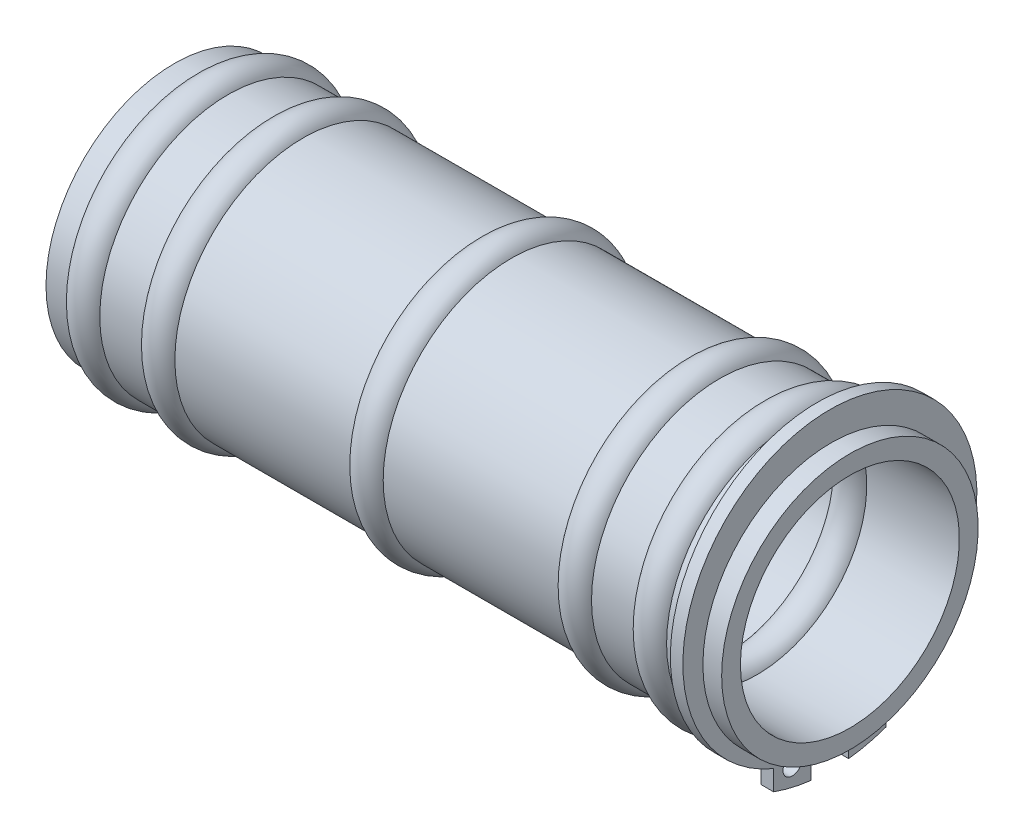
ISO-10303-21;
HEADER;
FILE_DESCRIPTION(('STEP AP214'),'2;1');
FILE_NAME('part.step','',(''),(''),'','','');
FILE_SCHEMA(('AUTOMOTIVE_DESIGN { 1 0 10303 214 1 1 1 1 }'));
ENDSEC;
DATA;
#1=APPLICATION_CONTEXT('core data for automotive mechanical design processes');
#2=APPLICATION_PROTOCOL_DEFINITION('international standard','automotive_design',2000,#1);
#3=PRODUCT_CONTEXT('',#1,'mechanical');
#4=PRODUCT('Part','Part','',(#3));
#5=PRODUCT_RELATED_PRODUCT_CATEGORY('part','',(#4));
#6=PRODUCT_DEFINITION_FORMATION('','',#4);
#7=PRODUCT_DEFINITION_CONTEXT('part definition',#1,'design');
#8=PRODUCT_DEFINITION('design','',#6,#7);
#9=PRODUCT_DEFINITION_SHAPE('','',#8);
#10=(LENGTH_UNIT() NAMED_UNIT(*) SI_UNIT(.MILLI.,.METRE.));
#11=(NAMED_UNIT(*) PLANE_ANGLE_UNIT() SI_UNIT($,.RADIAN.));
#12=(NAMED_UNIT(*) SI_UNIT($,.STERADIAN.) SOLID_ANGLE_UNIT());
#13=UNCERTAINTY_MEASURE_WITH_UNIT(LENGTH_MEASURE(1.E-05),#10,'distance_accuracy_value','');
#14=(GEOMETRIC_REPRESENTATION_CONTEXT(3) GLOBAL_UNCERTAINTY_ASSIGNED_CONTEXT((#13)) GLOBAL_UNIT_ASSIGNED_CONTEXT((#10,
#11,#12)) REPRESENTATION_CONTEXT('',''));
#15=CARTESIAN_POINT('',(0.,0.,0.));
#16=DIRECTION('',(0.,0.,1.));
#17=DIRECTION('',(1.,0.,0.));
#18=AXIS2_PLACEMENT_3D('',#15,#16,#17);
#19=CARTESIAN_POINT('',(54.,0.,0.));
#20=DIRECTION('',(-1.,0.,0.));
#21=DIRECTION('',(0.,0.,1.));
#22=AXIS2_PLACEMENT_3D('',#19,#20,#21);
#23=CYLINDRICAL_SURFACE('',#22,9.5);
#24=CARTESIAN_POINT('',(52.5,0.,0.));
#25=DIRECTION('',(-1.,0.,0.));
#26=DIRECTION('',(0.,0.,1.));
#27=AXIS2_PLACEMENT_3D('',#24,#25,#26);
#28=CIRCLE('',#27,9.5);
#29=CARTESIAN_POINT('',(52.5,0.,9.5));
#30=VERTEX_POINT('',#29);
#31=EDGE_CURVE('E203',#30,#30,#28,.T.);
#32=ORIENTED_EDGE('',*,*,#31,.T.);
#33=EDGE_LOOP('',(#32));
#34=FACE_BOUND('',#33,.T.);
#35=CARTESIAN_POINT('',(51.3,0.,0.));
#36=DIRECTION('',(-1.,0.,0.));
#37=DIRECTION('',(0.,0.,1.));
#38=AXIS2_PLACEMENT_3D('',#35,#36,#37);
#39=CIRCLE('',#38,9.5);
#40=CARTESIAN_POINT('',(51.3,0.,9.5));
#41=VERTEX_POINT('',#40);
#42=EDGE_CURVE('E200',#41,#41,#39,.T.);
#43=ORIENTED_EDGE('',*,*,#42,.F.);
#44=EDGE_LOOP('',(#43));
#45=FACE_BOUND('',#44,.T.);
#46=DIRECTION('',(-1.,0.,0.));
#47=VECTOR('',#46,1.);
#48=CARTESIAN_POINT('',(54.,-9.38083151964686,1.5));
#49=LINE('',#48,#47);
#50=CARTESIAN_POINT('',(51.4,-9.38083151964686,1.5));
#51=VERTEX_POINT('',#50);
#52=CARTESIAN_POINT('',(52.4,-9.38083151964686,1.5));
#53=VERTEX_POINT('',#52);
#54=EDGE_CURVE('E11',#51,#53,#49,.F.);
#55=ORIENTED_EDGE('',*,*,#54,.F.);
#56=CARTESIAN_POINT('',(51.4,0.,0.));
#57=DIRECTION('',(1.,0.,0.));
#58=DIRECTION('',(0.,0.,-1.));
#59=AXIS2_PLACEMENT_3D('',#56,#57,#58);
#60=CIRCLE('',#59,9.5);
#61=CARTESIAN_POINT('',(51.4,-9.38083151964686,-1.5));
#62=VERTEX_POINT('',#61);
#63=EDGE_CURVE('E237',#62,#51,#60,.T.);
#64=ORIENTED_EDGE('',*,*,#63,.F.);
#65=DIRECTION('',(-1.,0.,0.));
#66=VECTOR('',#65,1.);
#67=CARTESIAN_POINT('',(54.,-9.38083151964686,-1.5));
#68=LINE('',#67,#66);
#69=CARTESIAN_POINT('',(52.4,-9.38083151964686,-1.5));
#70=VERTEX_POINT('',#69);
#71=EDGE_CURVE('E170',#70,#62,#68,.T.);
#72=ORIENTED_EDGE('',*,*,#71,.F.);
#73=CARTESIAN_POINT('',(52.4,0.,0.));
#74=DIRECTION('',(1.,0.,0.));
#75=DIRECTION('',(0.,0.,-1.));
#76=AXIS2_PLACEMENT_3D('',#73,#74,#75);
#77=CIRCLE('',#76,9.5);
#78=EDGE_CURVE('E42',#70,#53,#77,.T.);
#79=ORIENTED_EDGE('',*,*,#78,.T.);
#80=EDGE_LOOP('',(#55,#64,#72,#79));
#81=FACE_BOUND('',#80,.T.);
#82=ADVANCED_FACE('F34',(#34,#45,#81),#23,.T.);
#83=CARTESIAN_POINT('',(54.,0.,0.));
#84=DIRECTION('',(-1.,0.,0.));
#85=DIRECTION('',(0.,0.,1.));
#86=AXIS2_PLACEMENT_3D('',#83,#84,#85);
#87=CYLINDRICAL_SURFACE('',#86,8.75);
#88=CARTESIAN_POINT('',(44.000961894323,0.,0.));
#89=DIRECTION('',(-1.,0.,0.));
#90=DIRECTION('',(0.,0.,1.));
#91=AXIS2_PLACEMENT_3D('',#88,#89,#90);
#92=CIRCLE('',#91,8.75);
#93=CARTESIAN_POINT('',(44.000961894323,0.,8.75));
#94=VERTEX_POINT('',#93);
#95=EDGE_CURVE('E218',#94,#94,#92,.T.);
#96=ORIENTED_EDGE('',*,*,#95,.F.);
#97=EDGE_LOOP('',(#96));
#98=FACE_BOUND('',#97,.T.);
#99=CARTESIAN_POINT('',(26.9490381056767,0.,0.));
#100=DIRECTION('',(-1.,0.,0.));
#101=DIRECTION('',(0.,0.,1.));
#102=AXIS2_PLACEMENT_3D('',#99,#100,#101);
#103=CIRCLE('',#102,8.75);
#104=CARTESIAN_POINT('',(26.9490381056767,0.,8.75));
#105=VERTEX_POINT('',#104);
#106=EDGE_CURVE('E163',#105,#105,#103,.F.);
#107=ORIENTED_EDGE('',*,*,#106,.F.);
#108=EDGE_LOOP('',(#107));
#109=FACE_BOUND('',#108,.T.);
#110=ADVANCED_FACE('F260',(#98,#109),#87,.F.);
#111=CARTESIAN_POINT('',(54.,0.,0.));
#112=DIRECTION('',(-1.,0.,0.));
#113=DIRECTION('',(0.,0.,1.));
#114=AXIS2_PLACEMENT_3D('',#111,#112,#113);
#115=CYLINDRICAL_SURFACE('',#114,10.25);
#116=CARTESIAN_POINT('',(41.000961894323,0.,0.));
#117=DIRECTION('',(-1.,0.,0.));
#118=DIRECTION('',(0.,0.,1.));
#119=AXIS2_PLACEMENT_3D('',#116,#117,#118);
#120=CIRCLE('',#119,10.25);
#121=CARTESIAN_POINT('',(41.000961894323,0.,10.25));
#122=VERTEX_POINT('',#121);
#123=EDGE_CURVE('E185',#122,#122,#120,.T.);
#124=ORIENTED_EDGE('',*,*,#123,.T.);
#125=EDGE_LOOP('',(#124));
#126=FACE_BOUND('',#125,.T.);
#127=CARTESIAN_POINT('',(26.9490381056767,0.,0.));
#128=DIRECTION('',(-1.,0.,0.));
#129=DIRECTION('',(0.,0.,1.));
#130=AXIS2_PLACEMENT_3D('',#127,#128,#129);
#131=CIRCLE('',#130,10.25);
#132=CARTESIAN_POINT('',(26.9490381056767,0.,10.25));
#133=VERTEX_POINT('',#132);
#134=EDGE_CURVE('E230',#133,#133,#131,.T.);
#135=ORIENTED_EDGE('',*,*,#134,.F.);
#136=EDGE_LOOP('',(#135));
#137=FACE_BOUND('',#136,.T.);
#138=ADVANCED_FACE('F266',(#126,#137),#115,.T.);
#139=CARTESIAN_POINT('',(45.3,0.,0.));
#140=DIRECTION('',(-1.,0.,0.));
#141=DIRECTION('',(0.,0.,1.));
#142=AXIS2_PLACEMENT_3D('',#139,#140,#141);
#143=TOROIDAL_SURFACE('',#142,9.50000000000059,1.50000000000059);
#144=CARTESIAN_POINT('',(46.599038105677,0.,0.));
#145=DIRECTION('',(-1.,0.,0.));
#146=DIRECTION('',(0.,0.,1.));
#147=AXIS2_PLACEMENT_3D('',#144,#145,#146);
#148=CIRCLE('',#147,8.75);
#149=CARTESIAN_POINT('',(46.599038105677,0.,8.75));
#150=VERTEX_POINT('',#149);
#151=EDGE_CURVE('E215',#150,#150,#148,.T.);
#152=ORIENTED_EDGE('',*,*,#151,.F.);
#153=EDGE_LOOP('',(#152));
#154=FACE_BOUND('',#153,.T.);
#155=ORIENTED_EDGE('',*,*,#95,.T.);
#156=EDGE_LOOP('',(#155));
#157=FACE_BOUND('',#156,.T.);
#158=ADVANCED_FACE('F290',(#154,#157),#143,.T.);
#159=CARTESIAN_POINT('',(54.,0.,0.));
#160=DIRECTION('',(-1.,0.,0.));
#161=DIRECTION('',(0.,0.,1.));
#162=AXIS2_PLACEMENT_3D('',#159,#160,#161);
#163=CYLINDRICAL_SURFACE('',#162,8.75);
#164=CARTESIAN_POINT('',(54.,0.,0.));
#165=DIRECTION('',(-1.,0.,0.));
#166=DIRECTION('',(0.,0.,1.));
#167=AXIS2_PLACEMENT_3D('',#164,#165,#166);
#168=CIRCLE('',#167,8.75);
#169=CARTESIAN_POINT('',(54.,0.,8.75));
#170=VERTEX_POINT('',#169);
#171=EDGE_CURVE('E212',#170,#170,#168,.T.);
#172=ORIENTED_EDGE('',*,*,#171,.F.);
#173=EDGE_LOOP('',(#172));
#174=FACE_BOUND('',#173,.T.);
#175=ORIENTED_EDGE('',*,*,#151,.T.);
#176=EDGE_LOOP('',(#175));
#177=FACE_BOUND('',#176,.T.);
#178=ADVANCED_FACE('F286',(#174,#177),#163,.F.);
#179=CARTESIAN_POINT('',(54.,8.75,0.));
#180=DIRECTION('',(-1.,0.,0.));
#181=DIRECTION('',(0.,0.,1.));
#182=AXIS2_PLACEMENT_3D('',#179,#180,#181);
#183=PLANE('',#182);
#184=CARTESIAN_POINT('',(54.,0.,0.));
#185=DIRECTION('',(-1.,0.,0.));
#186=DIRECTION('',(0.,0.,1.));
#187=AXIS2_PLACEMENT_3D('',#184,#185,#186);
#188=CIRCLE('',#187,10.25);
#189=CARTESIAN_POINT('',(54.,0.,10.25));
#190=VERTEX_POINT('',#189);
#191=EDGE_CURVE('E209',#190,#190,#188,.T.);
#192=ORIENTED_EDGE('',*,*,#191,.F.);
#193=EDGE_LOOP('',(#192));
#194=FACE_BOUND('',#193,.T.);
#195=ORIENTED_EDGE('',*,*,#171,.T.);
#196=EDGE_LOOP('',(#195));
#197=FACE_BOUND('',#196,.T.);
#198=ADVANCED_FACE('F282',(#194,#197),#183,.F.);
#199=CARTESIAN_POINT('',(54.,0.,0.));
#200=DIRECTION('',(-1.,0.,0.));
#201=DIRECTION('',(0.,0.,1.));
#202=AXIS2_PLACEMENT_3D('',#199,#200,#201);
#203=CYLINDRICAL_SURFACE('',#202,10.25);
#204=CARTESIAN_POINT('',(52.5,0.,0.));
#205=DIRECTION('',(-1.,0.,0.));
#206=DIRECTION('',(0.,0.,1.));
#207=AXIS2_PLACEMENT_3D('',#204,#205,#206);
#208=CIRCLE('',#207,10.25);
#209=CARTESIAN_POINT('',(52.5,0.,10.25));
#210=VERTEX_POINT('',#209);
#211=EDGE_CURVE('E206',#210,#210,#208,.T.);
#212=ORIENTED_EDGE('',*,*,#211,.F.);
#213=EDGE_LOOP('',(#212));
#214=FACE_BOUND('',#213,.T.);
#215=ORIENTED_EDGE('',*,*,#191,.T.);
#216=EDGE_LOOP('',(#215));
#217=FACE_BOUND('',#216,.T.);
#218=ADVANCED_FACE('F278',(#214,#217),#203,.T.);
#219=CARTESIAN_POINT('',(52.5,10.25,0.));
#220=DIRECTION('',(1.,0.,0.));
#221=DIRECTION('',(0.,0.,-1.));
#222=AXIS2_PLACEMENT_3D('',#219,#220,#221);
#223=PLANE('',#222);
#224=ORIENTED_EDGE('',*,*,#31,.F.);
#225=EDGE_LOOP('',(#224));
#226=FACE_BOUND('',#225,.T.);
#227=ORIENTED_EDGE('',*,*,#211,.T.);
#228=EDGE_LOOP('',(#227));
#229=FACE_BOUND('',#228,.T.);
#230=ADVANCED_FACE('F275',(#226,#229),#223,.F.);
#231=CARTESIAN_POINT('',(51.3,9.5,0.));
#232=DIRECTION('',(-1.,0.,0.));
#233=DIRECTION('',(0.,0.,1.));
#234=AXIS2_PLACEMENT_3D('',#231,#232,#233);
#235=PLANE('',#234);
#236=CARTESIAN_POINT('',(51.3,0.,0.));
#237=DIRECTION('',(-1.,0.,0.));
#238=DIRECTION('',(0.,0.,1.));
#239=AXIS2_PLACEMENT_3D('',#236,#237,#238);
#240=CIRCLE('',#239,10.25);
#241=CARTESIAN_POINT('',(51.3,0.,10.25));
#242=VERTEX_POINT('',#241);
#243=EDGE_CURVE('E197',#242,#242,#240,.T.);
#244=ORIENTED_EDGE('',*,*,#243,.F.);
#245=EDGE_LOOP('',(#244));
#246=FACE_BOUND('',#245,.T.);
#247=ORIENTED_EDGE('',*,*,#42,.T.);
#248=EDGE_LOOP('',(#247));
#249=FACE_BOUND('',#248,.T.);
#250=ADVANCED_FACE('F273',(#246,#249),#235,.F.);
#251=CARTESIAN_POINT('',(54.,0.,0.));
#252=DIRECTION('',(-1.,0.,0.));
#253=DIRECTION('',(0.,0.,1.));
#254=AXIS2_PLACEMENT_3D('',#251,#252,#253);
#255=CYLINDRICAL_SURFACE('',#254,10.25);
#256=CARTESIAN_POINT('',(49.599038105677,0.,0.));
#257=DIRECTION('',(-1.,0.,0.));
#258=DIRECTION('',(0.,0.,1.));
#259=AXIS2_PLACEMENT_3D('',#256,#257,#258);
#260=CIRCLE('',#259,10.25);
#261=CARTESIAN_POINT('',(49.599038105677,0.,10.25));
#262=VERTEX_POINT('',#261);
#263=EDGE_CURVE('E194',#262,#262,#260,.T.);
#264=ORIENTED_EDGE('',*,*,#263,.F.);
#265=EDGE_LOOP('',(#264));
#266=FACE_BOUND('',#265,.T.);
#267=ORIENTED_EDGE('',*,*,#243,.T.);
#268=EDGE_LOOP('',(#267));
#269=FACE_BOUND('',#268,.T.);
#270=ADVANCED_FACE('F492',(#266,#269),#255,.T.);
#271=CARTESIAN_POINT('',(48.3,0.,0.));
#272=DIRECTION('',(-1.,0.,0.));
#273=DIRECTION('',(0.,0.,1.));
#274=AXIS2_PLACEMENT_3D('',#271,#272,#273);
#275=TOROIDAL_SURFACE('',#274,9.4999999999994,1.5000000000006);
#276=CARTESIAN_POINT('',(47.000961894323,0.,0.));
#277=DIRECTION('',(-1.,0.,0.));
#278=DIRECTION('',(0.,0.,1.));
#279=AXIS2_PLACEMENT_3D('',#276,#277,#278);
#280=CIRCLE('',#279,10.25);
#281=CARTESIAN_POINT('',(47.000961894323,0.,10.25));
#282=VERTEX_POINT('',#281);
#283=EDGE_CURVE('E191',#282,#282,#280,.T.);
#284=ORIENTED_EDGE('',*,*,#283,.F.);
#285=EDGE_LOOP('',(#284));
#286=FACE_BOUND('',#285,.T.);
#287=ORIENTED_EDGE('',*,*,#263,.T.);
#288=EDGE_LOOP('',(#287));
#289=FACE_BOUND('',#288,.T.);
#290=ADVANCED_FACE('F501',(#286,#289),#275,.T.);
#291=CARTESIAN_POINT('',(54.,0.,0.));
#292=DIRECTION('',(-1.,0.,0.));
#293=DIRECTION('',(0.,0.,1.));
#294=AXIS2_PLACEMENT_3D('',#291,#292,#293);
#295=CYLINDRICAL_SURFACE('',#294,10.25);
#296=CARTESIAN_POINT('',(43.599038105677,0.,0.));
#297=DIRECTION('',(-1.,0.,0.));
#298=DIRECTION('',(0.,0.,1.));
#299=AXIS2_PLACEMENT_3D('',#296,#297,#298);
#300=CIRCLE('',#299,10.25);
#301=CARTESIAN_POINT('',(43.599038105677,0.,10.25));
#302=VERTEX_POINT('',#301);
#303=EDGE_CURVE('E188',#302,#302,#300,.T.);
#304=ORIENTED_EDGE('',*,*,#303,.F.);
#305=EDGE_LOOP('',(#304));
#306=FACE_BOUND('',#305,.T.);
#307=ORIENTED_EDGE('',*,*,#283,.T.);
#308=EDGE_LOOP('',(#307));
#309=FACE_BOUND('',#308,.T.);
#310=ADVANCED_FACE('F352',(#306,#309),#295,.T.);
#311=CARTESIAN_POINT('',(42.3,0.,0.));
#312=DIRECTION('',(-1.,0.,0.));
#313=DIRECTION('',(0.,0.,1.));
#314=AXIS2_PLACEMENT_3D('',#311,#312,#313);
#315=TOROIDAL_SURFACE('',#314,9.4999999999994,1.5000000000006);
#316=ORIENTED_EDGE('',*,*,#123,.F.);
#317=EDGE_LOOP('',(#316));
#318=FACE_BOUND('',#317,.T.);
#319=ORIENTED_EDGE('',*,*,#303,.T.);
#320=EDGE_LOOP('',(#319));
#321=FACE_BOUND('',#320,.T.);
#322=ADVANCED_FACE('F346',(#318,#321),#315,.T.);
#323=CARTESIAN_POINT('',(25.65,0.,0.));
#324=DIRECTION('',(-1.,0.,0.));
#325=DIRECTION('',(0.,0.,1.));
#326=AXIS2_PLACEMENT_3D('',#323,#324,#325);
#327=TOROIDAL_SURFACE('',#326,9.5,1.5);
#328=ORIENTED_EDGE('',*,*,#134,.T.);
#329=EDGE_LOOP('',(#328));
#330=FACE_BOUND('',#329,.T.);
#331=CARTESIAN_POINT('',(24.3509618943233,0.,0.));
#332=DIRECTION('',(1.,0.,0.));
#333=DIRECTION('',(0.,0.,-1.));
#334=AXIS2_PLACEMENT_3D('',#331,#332,#333);
#335=CIRCLE('',#334,10.25);
#336=CARTESIAN_POINT('',(24.3509618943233,0.,-10.25));
#337=VERTEX_POINT('',#336);
#338=EDGE_CURVE('E167',#337,#337,#335,.T.);
#339=ORIENTED_EDGE('',*,*,#338,.T.);
#340=EDGE_LOOP('',(#339));
#341=FACE_BOUND('',#340,.T.);
#342=ADVANCED_FACE('F307',(#330,#341),#327,.T.);
#343=CARTESIAN_POINT('',(0.,10.25,0.));
#344=DIRECTION('',(1.,0.,0.));
#345=DIRECTION('',(0.,0.,-1.));
#346=AXIS2_PLACEMENT_3D('',#343,#344,#345);
#347=PLANE('',#346);
#348=CARTESIAN_POINT('',(0.,0.,0.));
#349=DIRECTION('',(-1.,0.,0.));
#350=DIRECTION('',(0.,0.,1.));
#351=AXIS2_PLACEMENT_3D('',#348,#349,#350);
#352=CIRCLE('',#351,8.75);
#353=CARTESIAN_POINT('',(0.,0.,8.75));
#354=VERTEX_POINT('',#353);
#355=EDGE_CURVE('E227',#354,#354,#352,.T.);
#356=ORIENTED_EDGE('',*,*,#355,.F.);
#357=EDGE_LOOP('',(#356));
#358=FACE_BOUND('',#357,.T.);
#359=CARTESIAN_POINT('',(0.,0.,0.));
#360=DIRECTION('',(-1.,0.,0.));
#361=DIRECTION('',(0.,0.,1.));
#362=AXIS2_PLACEMENT_3D('',#359,#360,#361);
#363=CIRCLE('',#362,10.25);
#364=CARTESIAN_POINT('',(0.,0.,10.25));
#365=VERTEX_POINT('',#364);
#366=EDGE_CURVE('E114',#365,#365,#363,.T.);
#367=ORIENTED_EDGE('',*,*,#366,.T.);
#368=EDGE_LOOP('',(#367));
#369=FACE_BOUND('',#368,.T.);
#370=ADVANCED_FACE('F36',(#358,#369),#347,.F.);
#371=CARTESIAN_POINT('',(54.,0.,0.));
#372=DIRECTION('',(-1.,0.,0.));
#373=DIRECTION('',(0.,0.,1.));
#374=AXIS2_PLACEMENT_3D('',#371,#372,#373);
#375=CYLINDRICAL_SURFACE('',#374,8.75);
#376=CARTESIAN_POINT('',(4.7009618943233,0.,0.));
#377=DIRECTION('',(-1.,0.,0.));
#378=DIRECTION('',(0.,0.,1.));
#379=AXIS2_PLACEMENT_3D('',#376,#377,#378);
#380=CIRCLE('',#379,8.75);
#381=CARTESIAN_POINT('',(4.7009618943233,0.,8.75));
#382=VERTEX_POINT('',#381);
#383=EDGE_CURVE('E224',#382,#382,#380,.T.);
#384=ORIENTED_EDGE('',*,*,#383,.F.);
#385=EDGE_LOOP('',(#384));
#386=FACE_BOUND('',#385,.T.);
#387=ORIENTED_EDGE('',*,*,#355,.T.);
#388=EDGE_LOOP('',(#387));
#389=FACE_BOUND('',#388,.T.);
#390=ADVANCED_FACE('F300',(#386,#389),#375,.F.);
#391=CARTESIAN_POINT('',(6.,0.,0.));
#392=DIRECTION('',(-1.,0.,0.));
#393=DIRECTION('',(0.,0.,1.));
#394=AXIS2_PLACEMENT_3D('',#391,#392,#393);
#395=TOROIDAL_SURFACE('',#394,9.50000000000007,1.50000000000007);
#396=CARTESIAN_POINT('',(7.2990381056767,0.,0.));
#397=DIRECTION('',(-1.,0.,0.));
#398=DIRECTION('',(0.,0.,1.));
#399=AXIS2_PLACEMENT_3D('',#396,#397,#398);
#400=CIRCLE('',#399,8.75);
#401=CARTESIAN_POINT('',(7.2990381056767,0.,8.75));
#402=VERTEX_POINT('',#401);
#403=EDGE_CURVE('E221',#402,#402,#400,.T.);
#404=ORIENTED_EDGE('',*,*,#403,.F.);
#405=EDGE_LOOP('',(#404));
#406=FACE_BOUND('',#405,.T.);
#407=ORIENTED_EDGE('',*,*,#383,.T.);
#408=EDGE_LOOP('',(#407));
#409=FACE_BOUND('',#408,.T.);
#410=ADVANCED_FACE('F297',(#406,#409),#395,.T.);
#411=ORIENTED_EDGE('',*,*,#403,.T.);
#412=EDGE_LOOP('',(#411));
#413=FACE_BOUND('',#412,.T.);
#414=CARTESIAN_POINT('',(24.3509618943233,0.,0.));
#415=DIRECTION('',(1.,0.,0.));
#416=DIRECTION('',(0.,0.,-1.));
#417=AXIS2_PLACEMENT_3D('',#414,#415,#416);
#418=CIRCLE('',#417,8.75);
#419=CARTESIAN_POINT('',(24.3509618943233,0.,-8.75));
#420=VERTEX_POINT('',#419);
#421=EDGE_CURVE('E166',#420,#420,#418,.F.);
#422=ORIENTED_EDGE('',*,*,#421,.F.);
#423=EDGE_LOOP('',(#422));
#424=FACE_BOUND('',#423,.T.);
#425=ADVANCED_FACE('F269',(#413,#424),#87,.F.);
#426=CARTESIAN_POINT('',(54.,0.,0.));
#427=DIRECTION('',(-1.,0.,0.));
#428=DIRECTION('',(0.,0.,1.));
#429=AXIS2_PLACEMENT_3D('',#426,#427,#428);
#430=CYLINDRICAL_SURFACE('',#429,10.25);
#431=ORIENTED_EDGE('',*,*,#366,.F.);
#432=EDGE_LOOP('',(#431));
#433=FACE_BOUND('',#432,.T.);
#434=CARTESIAN_POINT('',(1.7009618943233,0.,0.));
#435=DIRECTION('',(-1.,0.,0.));
#436=DIRECTION('',(0.,0.,1.));
#437=AXIS2_PLACEMENT_3D('',#434,#435,#436);
#438=CIRCLE('',#437,10.25);
#439=CARTESIAN_POINT('',(1.7009618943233,0.,10.25));
#440=VERTEX_POINT('',#439);
#441=EDGE_CURVE('E173',#440,#440,#438,.T.);
#442=ORIENTED_EDGE('',*,*,#441,.T.);
#443=EDGE_LOOP('',(#442));
#444=FACE_BOUND('',#443,.T.);
#445=ADVANCED_FACE('F296',(#433,#444),#430,.T.);
#446=CARTESIAN_POINT('',(3.,0.,0.));
#447=DIRECTION('',(-1.,0.,0.));
#448=DIRECTION('',(0.,0.,1.));
#449=AXIS2_PLACEMENT_3D('',#446,#447,#448);
#450=TOROIDAL_SURFACE('',#449,9.49999999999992,1.50000000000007);
#451=ORIENTED_EDGE('',*,*,#441,.F.);
#452=EDGE_LOOP('',(#451));
#453=FACE_BOUND('',#452,.T.);
#454=CARTESIAN_POINT('',(4.2990381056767,0.,0.));
#455=DIRECTION('',(-1.,0.,0.));
#456=DIRECTION('',(0.,0.,1.));
#457=AXIS2_PLACEMENT_3D('',#454,#455,#456);
#458=CIRCLE('',#457,10.25);
#459=CARTESIAN_POINT('',(4.2990381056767,0.,10.25));
#460=VERTEX_POINT('',#459);
#461=EDGE_CURVE('E176',#460,#460,#458,.T.);
#462=ORIENTED_EDGE('',*,*,#461,.T.);
#463=EDGE_LOOP('',(#462));
#464=FACE_BOUND('',#463,.T.);
#465=ADVANCED_FACE('F317',(#453,#464),#450,.T.);
#466=CARTESIAN_POINT('',(54.,0.,0.));
#467=DIRECTION('',(-1.,0.,0.));
#468=DIRECTION('',(0.,0.,1.));
#469=AXIS2_PLACEMENT_3D('',#466,#467,#468);
#470=CYLINDRICAL_SURFACE('',#469,10.25);
#471=ORIENTED_EDGE('',*,*,#461,.F.);
#472=EDGE_LOOP('',(#471));
#473=FACE_BOUND('',#472,.T.);
#474=CARTESIAN_POINT('',(7.7009618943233,0.,0.));
#475=DIRECTION('',(-1.,0.,0.));
#476=DIRECTION('',(0.,0.,1.));
#477=AXIS2_PLACEMENT_3D('',#474,#475,#476);
#478=CIRCLE('',#477,10.25);
#479=CARTESIAN_POINT('',(7.7009618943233,0.,10.25));
#480=VERTEX_POINT('',#479);
#481=EDGE_CURVE('E179',#480,#480,#478,.T.);
#482=ORIENTED_EDGE('',*,*,#481,.T.);
#483=EDGE_LOOP('',(#482));
#484=FACE_BOUND('',#483,.T.);
#485=ADVANCED_FACE('F323',(#473,#484),#470,.T.);
#486=CARTESIAN_POINT('',(9.00000000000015,0.,0.));
#487=DIRECTION('',(-1.,0.,0.));
#488=DIRECTION('',(0.,0.,1.));
#489=AXIS2_PLACEMENT_3D('',#486,#487,#488);
#490=TOROIDAL_SURFACE('',#489,9.49999999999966,1.50000000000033);
#491=ORIENTED_EDGE('',*,*,#481,.F.);
#492=EDGE_LOOP('',(#491));
#493=FACE_BOUND('',#492,.T.);
#494=CARTESIAN_POINT('',(10.299038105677,0.,0.));
#495=DIRECTION('',(-1.,0.,0.));
#496=DIRECTION('',(0.,0.,1.));
#497=AXIS2_PLACEMENT_3D('',#494,#495,#496);
#498=CIRCLE('',#497,10.25);
#499=CARTESIAN_POINT('',(10.299038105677,0.,10.25));
#500=VERTEX_POINT('',#499);
#501=EDGE_CURVE('E182',#500,#500,#498,.T.);
#502=ORIENTED_EDGE('',*,*,#501,.T.);
#503=EDGE_LOOP('',(#502));
#504=FACE_BOUND('',#503,.T.);
#505=ADVANCED_FACE('F329',(#493,#504),#490,.T.);
#506=ORIENTED_EDGE('',*,*,#501,.F.);
#507=EDGE_LOOP('',(#506));
#508=FACE_BOUND('',#507,.T.);
#509=ORIENTED_EDGE('',*,*,#338,.F.);
#510=EDGE_LOOP('',(#509));
#511=FACE_BOUND('',#510,.T.);
#512=ADVANCED_FACE('F335',(#508,#511),#115,.T.);
#513=ORIENTED_EDGE('',*,*,#106,.T.);
#514=EDGE_LOOP('',(#513));
#515=FACE_BOUND('',#514,.T.);
#516=ORIENTED_EDGE('',*,*,#421,.T.);
#517=EDGE_LOOP('',(#516));
#518=FACE_BOUND('',#517,.T.);
#519=ADVANCED_FACE('F341',(#515,#518),#327,.T.);
#520=CARTESIAN_POINT('',(52.4,0.750000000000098,0.));
#521=DIRECTION('',(1.,0.,0.));
#522=DIRECTION('',(0.,0.,-1.));
#523=AXIS2_PLACEMENT_3D('',#520,#521,#522);
#524=PLANE('',#523);
#525=CARTESIAN_POINT('',(52.4,-10.610567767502,3.));
#526=DIRECTION('',(1.,0.,0.));
#527=DIRECTION('',(0.,0.,-1.));
#528=AXIS2_PLACEMENT_3D('',#525,#526,#527);
#529=CIRCLE('',#528,0.75);
#530=CARTESIAN_POINT('',(52.4,-10.610567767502,2.25));
#531=VERTEX_POINT('',#530);
#532=EDGE_CURVE('E695',#531,#531,#529,.T.);
#533=ORIENTED_EDGE('',*,*,#532,.F.);
#534=EDGE_LOOP('',(#533));
#535=FACE_BOUND('',#534,.T.);
#536=CARTESIAN_POINT('',(52.4,-10.610567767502,-3.));
#537=DIRECTION('',(1.,0.,0.));
#538=DIRECTION('',(0.,0.,-1.));
#539=AXIS2_PLACEMENT_3D('',#536,#537,#538);
#540=CIRCLE('',#539,0.75);
#541=CARTESIAN_POINT('',(52.4,-10.610567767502,-3.75));
#542=VERTEX_POINT('',#541);
#543=EDGE_CURVE('E121',#542,#542,#540,.T.);
#544=ORIENTED_EDGE('',*,*,#543,.F.);
#545=EDGE_LOOP('',(#544));
#546=FACE_BOUND('',#545,.T.);
#547=ORIENTED_EDGE('',*,*,#78,.F.);
#548=DIRECTION('',(0.,-1.,0.));
#549=VECTOR('',#548,1.);
#550=CARTESIAN_POINT('',(52.4,-9.178235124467,-1.5));
#551=LINE('',#550,#549);
#552=CARTESIAN_POINT('',(52.4,-12.414820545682,-1.49999999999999));
#553=VERTEX_POINT('',#552);
#554=EDGE_CURVE('E146',#70,#553,#551,.T.);
#555=ORIENTED_EDGE('',*,*,#554,.T.);
#556=CARTESIAN_POINT('',(52.4,0.750000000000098,0.));
#557=DIRECTION('',(1.,0.,0.));
#558=DIRECTION('',(0.,0.,-1.));
#559=AXIS2_PLACEMENT_3D('',#556,#557,#558);
#560=CIRCLE('',#559,13.2500000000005);
#561=CARTESIAN_POINT('',(52.4,-11.712443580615,-4.5));
#562=VERTEX_POINT('',#561);
#563=EDGE_CURVE('E148',#553,#562,#560,.T.);
#564=ORIENTED_EDGE('',*,*,#563,.T.);
#565=DIRECTION('',(0.,1.,0.));
#566=VECTOR('',#565,1.);
#567=CARTESIAN_POINT('',(52.4,-11.712443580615,-4.5));
#568=LINE('',#567,#566);
#569=CARTESIAN_POINT('',(52.4,-10.104146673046,-4.5));
#570=VERTEX_POINT('',#569);
#571=EDGE_CURVE('E150',#562,#570,#568,.T.);
#572=ORIENTED_EDGE('',*,*,#571,.T.);
#573=CARTESIAN_POINT('',(52.4,0.750000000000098,0.));
#574=DIRECTION('',(1.,0.,0.));
#575=DIRECTION('',(0.,0.,-1.));
#576=AXIS2_PLACEMENT_3D('',#573,#574,#575);
#577=CIRCLE('',#576,11.7499999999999);
#578=CARTESIAN_POINT('',(52.4,-10.104146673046,4.5));
#579=VERTEX_POINT('',#578);
#580=EDGE_CURVE('E138',#570,#579,#577,.T.);
#581=ORIENTED_EDGE('',*,*,#580,.T.);
#582=DIRECTION('',(0.,-1.,0.));
#583=VECTOR('',#582,1.);
#584=CARTESIAN_POINT('',(52.4,-10.104146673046,4.5));
#585=LINE('',#584,#583);
#586=CARTESIAN_POINT('',(52.4,-11.712443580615,4.5));
#587=VERTEX_POINT('',#586);
#588=EDGE_CURVE('E110',#579,#587,#585,.T.);
#589=ORIENTED_EDGE('',*,*,#588,.T.);
#590=CARTESIAN_POINT('',(52.4,0.750000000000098,0.));
#591=DIRECTION('',(1.,0.,0.));
#592=DIRECTION('',(0.,0.,-1.));
#593=AXIS2_PLACEMENT_3D('',#590,#591,#592);
#594=CIRCLE('',#593,13.2500000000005);
#595=CARTESIAN_POINT('',(52.4,-12.414820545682,1.5));
#596=VERTEX_POINT('',#595);
#597=EDGE_CURVE('E141',#587,#596,#594,.T.);
#598=ORIENTED_EDGE('',*,*,#597,.T.);
#599=DIRECTION('',(0.,1.,0.));
#600=VECTOR('',#599,1.);
#601=CARTESIAN_POINT('',(52.4,-12.414820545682,1.5));
#602=LINE('',#601,#600);
#603=EDGE_CURVE('E143',#596,#53,#602,.T.);
#604=ORIENTED_EDGE('',*,*,#603,.T.);
#605=EDGE_LOOP('',(#547,#555,#564,#572,#581,#589,#598,#604));
#606=FACE_BOUND('',#605,.T.);
#607=ADVANCED_FACE('F247',(#535,#546,#606),#524,.T.);
#608=CARTESIAN_POINT('',(51.4,0.750000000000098,0.));
#609=DIRECTION('',(1.,0.,0.));
#610=DIRECTION('',(0.,0.,-1.));
#611=AXIS2_PLACEMENT_3D('',#608,#609,#610);
#612=PLANE('',#611);
#613=CARTESIAN_POINT('',(51.4,-10.610567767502,3.));
#614=DIRECTION('',(1.,0.,0.));
#615=DIRECTION('',(0.,0.,-1.));
#616=AXIS2_PLACEMENT_3D('',#613,#614,#615);
#617=CIRCLE('',#616,0.75);
#618=CARTESIAN_POINT('',(51.4,-10.610567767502,2.25));
#619=VERTEX_POINT('',#618);
#620=EDGE_CURVE('E698',#619,#619,#617,.T.);
#621=ORIENTED_EDGE('',*,*,#620,.T.);
#622=EDGE_LOOP('',(#621));
#623=FACE_BOUND('',#622,.T.);
#624=CARTESIAN_POINT('',(51.4,-10.610567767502,-3.));
#625=DIRECTION('',(1.,0.,0.));
#626=DIRECTION('',(0.,0.,-1.));
#627=AXIS2_PLACEMENT_3D('',#624,#625,#626);
#628=CIRCLE('',#627,0.75);
#629=CARTESIAN_POINT('',(51.4,-10.610567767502,-3.75));
#630=VERTEX_POINT('',#629);
#631=EDGE_CURVE('E124',#630,#630,#628,.T.);
#632=ORIENTED_EDGE('',*,*,#631,.T.);
#633=EDGE_LOOP('',(#632));
#634=FACE_BOUND('',#633,.T.);
#635=DIRECTION('',(0.,-1.,0.));
#636=VECTOR('',#635,1.);
#637=CARTESIAN_POINT('',(51.4,-9.178235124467,-1.5));
#638=LINE('',#637,#636);
#639=CARTESIAN_POINT('',(51.4,-12.414820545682,-1.49999999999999));
#640=VERTEX_POINT('',#639);
#641=EDGE_CURVE('E132',#62,#640,#638,.T.);
#642=ORIENTED_EDGE('',*,*,#641,.F.);
#643=ORIENTED_EDGE('',*,*,#63,.T.);
#644=DIRECTION('',(0.,1.,0.));
#645=VECTOR('',#644,1.);
#646=CARTESIAN_POINT('',(51.4,-12.414820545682,1.5));
#647=LINE('',#646,#645);
#648=CARTESIAN_POINT('',(51.4,-12.414820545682,1.5));
#649=VERTEX_POINT('',#648);
#650=EDGE_CURVE('E129',#649,#51,#647,.T.);
#651=ORIENTED_EDGE('',*,*,#650,.F.);
#652=CARTESIAN_POINT('',(51.4,0.750000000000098,0.));
#653=DIRECTION('',(1.,0.,0.));
#654=DIRECTION('',(0.,0.,-1.));
#655=AXIS2_PLACEMENT_3D('',#652,#653,#654);
#656=CIRCLE('',#655,13.2500000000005);
#657=CARTESIAN_POINT('',(51.4,-11.712443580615,4.5));
#658=VERTEX_POINT('',#657);
#659=EDGE_CURVE('E102',#658,#649,#656,.T.);
#660=ORIENTED_EDGE('',*,*,#659,.F.);
#661=DIRECTION('',(0.,-1.,0.));
#662=VECTOR('',#661,1.);
#663=CARTESIAN_POINT('',(51.4,-10.104146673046,4.5));
#664=LINE('',#663,#662);
#665=CARTESIAN_POINT('',(51.4,-10.104146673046,4.5));
#666=VERTEX_POINT('',#665);
#667=EDGE_CURVE('E94',#666,#658,#664,.T.);
#668=ORIENTED_EDGE('',*,*,#667,.F.);
#669=CARTESIAN_POINT('',(51.4,0.750000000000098,0.));
#670=DIRECTION('',(1.,0.,0.));
#671=DIRECTION('',(0.,0.,-1.));
#672=AXIS2_PLACEMENT_3D('',#669,#670,#671);
#673=CIRCLE('',#672,11.7499999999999);
#674=CARTESIAN_POINT('',(51.4,-10.104146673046,-4.5));
#675=VERTEX_POINT('',#674);
#676=EDGE_CURVE('E100',#675,#666,#673,.T.);
#677=ORIENTED_EDGE('',*,*,#676,.F.);
#678=DIRECTION('',(0.,1.,0.));
#679=VECTOR('',#678,1.);
#680=CARTESIAN_POINT('',(51.4,-11.712443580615,-4.5));
#681=LINE('',#680,#679);
#682=CARTESIAN_POINT('',(51.4,-11.712443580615,-4.5));
#683=VERTEX_POINT('',#682);
#684=EDGE_CURVE('E136',#683,#675,#681,.T.);
#685=ORIENTED_EDGE('',*,*,#684,.F.);
#686=CARTESIAN_POINT('',(51.4,0.750000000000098,0.));
#687=DIRECTION('',(1.,0.,0.));
#688=DIRECTION('',(0.,0.,-1.));
#689=AXIS2_PLACEMENT_3D('',#686,#687,#688);
#690=CIRCLE('',#689,13.2500000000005);
#691=EDGE_CURVE('E134',#640,#683,#690,.T.);
#692=ORIENTED_EDGE('',*,*,#691,.F.);
#693=EDGE_LOOP('',(#642,#643,#651,#660,#668,#677,#685,#692));
#694=FACE_BOUND('',#693,.T.);
#695=ADVANCED_FACE('F97',(#623,#634,#694),#612,.F.);
#696=CARTESIAN_POINT('',(52.4,-12.414820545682,1.5));
#697=DIRECTION('',(0.,0.,1.));
#698=DIRECTION('',(1.,0.,0.));
#699=AXIS2_PLACEMENT_3D('',#696,#697,#698);
#700=PLANE('',#699);
#701=ORIENTED_EDGE('',*,*,#650,.T.);
#702=ORIENTED_EDGE('',*,*,#54,.T.);
#703=ORIENTED_EDGE('',*,*,#603,.F.);
#704=DIRECTION('',(-1.,0.,0.));
#705=VECTOR('',#704,1.);
#706=CARTESIAN_POINT('',(52.4,-12.414820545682,1.5));
#707=LINE('',#706,#705);
#708=EDGE_CURVE('E159',#596,#649,#707,.T.);
#709=ORIENTED_EDGE('',*,*,#708,.T.);
#710=EDGE_LOOP('',(#701,#702,#703,#709));
#711=FACE_BOUND('',#710,.T.);
#712=ADVANCED_FACE('F240',(#711),#700,.F.);
#713=CARTESIAN_POINT('',(52.4,-9.178235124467,-1.5));
#714=DIRECTION('',(0.,0.,-1.));
#715=DIRECTION('',(-1.,0.,0.));
#716=AXIS2_PLACEMENT_3D('',#713,#714,#715);
#717=PLANE('',#716);
#718=ORIENTED_EDGE('',*,*,#554,.F.);
#719=ORIENTED_EDGE('',*,*,#71,.T.);
#720=ORIENTED_EDGE('',*,*,#641,.T.);
#721=DIRECTION('',(-1.,0.,0.));
#722=VECTOR('',#721,1.);
#723=CARTESIAN_POINT('',(52.4,-12.414820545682,-1.49999999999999));
#724=LINE('',#723,#722);
#725=EDGE_CURVE('E156',#553,#640,#724,.T.);
#726=ORIENTED_EDGE('',*,*,#725,.F.);
#727=EDGE_LOOP('',(#718,#719,#720,#726));
#728=FACE_BOUND('',#727,.T.);
#729=ADVANCED_FACE('F258',(#728),#717,.F.);
#730=CARTESIAN_POINT('',(52.4,0.750000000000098,0.));
#731=DIRECTION('',(-1.,0.,0.));
#732=DIRECTION('',(0.,0.,1.));
#733=AXIS2_PLACEMENT_3D('',#730,#731,#732);
#734=CYLINDRICAL_SURFACE('',#733,11.7499999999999);
#735=ORIENTED_EDGE('',*,*,#676,.T.);
#736=DIRECTION('',(-1.,0.,0.));
#737=VECTOR('',#736,1.);
#738=CARTESIAN_POINT('',(52.4,-10.104146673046,4.5));
#739=LINE('',#738,#737);
#740=EDGE_CURVE('E108',#579,#666,#739,.T.);
#741=ORIENTED_EDGE('',*,*,#740,.F.);
#742=ORIENTED_EDGE('',*,*,#580,.F.);
#743=DIRECTION('',(-1.,0.,0.));
#744=VECTOR('',#743,1.);
#745=CARTESIAN_POINT('',(52.4,-10.104146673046,-4.5));
#746=LINE('',#745,#744);
#747=EDGE_CURVE('E120',#570,#675,#746,.T.);
#748=ORIENTED_EDGE('',*,*,#747,.T.);
#749=EDGE_LOOP('',(#735,#741,#742,#748));
#750=FACE_BOUND('',#749,.T.);
#751=ADVANCED_FACE('F118',(#750),#734,.T.);
#752=CARTESIAN_POINT('',(52.4,-10.104146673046,4.5));
#753=DIRECTION('',(0.,0.,-1.));
#754=DIRECTION('',(-1.,0.,0.));
#755=AXIS2_PLACEMENT_3D('',#752,#753,#754);
#756=PLANE('',#755);
#757=ORIENTED_EDGE('',*,*,#667,.T.);
#758=DIRECTION('',(-1.,0.,0.));
#759=VECTOR('',#758,1.);
#760=CARTESIAN_POINT('',(52.4,-11.712443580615,4.5));
#761=LINE('',#760,#759);
#762=EDGE_CURVE('E115',#587,#658,#761,.T.);
#763=ORIENTED_EDGE('',*,*,#762,.F.);
#764=ORIENTED_EDGE('',*,*,#588,.F.);
#765=ORIENTED_EDGE('',*,*,#740,.T.);
#766=EDGE_LOOP('',(#757,#763,#764,#765));
#767=FACE_BOUND('',#766,.T.);
#768=ADVANCED_FACE('F109',(#767),#756,.F.);
#769=CARTESIAN_POINT('',(52.4,0.750000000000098,0.));
#770=DIRECTION('',(-1.,0.,0.));
#771=DIRECTION('',(0.,0.,1.));
#772=AXIS2_PLACEMENT_3D('',#769,#770,#771);
#773=CYLINDRICAL_SURFACE('',#772,13.2500000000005);
#774=ORIENTED_EDGE('',*,*,#659,.T.);
#775=ORIENTED_EDGE('',*,*,#708,.F.);
#776=ORIENTED_EDGE('',*,*,#597,.F.);
#777=ORIENTED_EDGE('',*,*,#762,.T.);
#778=EDGE_LOOP('',(#774,#775,#776,#777));
#779=FACE_BOUND('',#778,.T.);
#780=ADVANCED_FACE('F245',(#779),#773,.T.);
#781=CARTESIAN_POINT('',(52.4,0.750000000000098,0.));
#782=DIRECTION('',(-1.,0.,0.));
#783=DIRECTION('',(0.,0.,1.));
#784=AXIS2_PLACEMENT_3D('',#781,#782,#783);
#785=CYLINDRICAL_SURFACE('',#784,13.2500000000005);
#786=ORIENTED_EDGE('',*,*,#691,.T.);
#787=DIRECTION('',(-1.,0.,0.));
#788=VECTOR('',#787,1.);
#789=CARTESIAN_POINT('',(52.4,-11.712443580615,-4.5));
#790=LINE('',#789,#788);
#791=EDGE_CURVE('E153',#562,#683,#790,.T.);
#792=ORIENTED_EDGE('',*,*,#791,.F.);
#793=ORIENTED_EDGE('',*,*,#563,.F.);
#794=ORIENTED_EDGE('',*,*,#725,.T.);
#795=EDGE_LOOP('',(#786,#792,#793,#794));
#796=FACE_BOUND('',#795,.T.);
#797=ADVANCED_FACE('F254',(#796),#785,.T.);
#798=CARTESIAN_POINT('',(52.4,-11.712443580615,-4.5));
#799=DIRECTION('',(0.,0.,1.));
#800=DIRECTION('',(1.,0.,0.));
#801=AXIS2_PLACEMENT_3D('',#798,#799,#800);
#802=PLANE('',#801);
#803=ORIENTED_EDGE('',*,*,#684,.T.);
#804=ORIENTED_EDGE('',*,*,#747,.F.);
#805=ORIENTED_EDGE('',*,*,#571,.F.);
#806=ORIENTED_EDGE('',*,*,#791,.T.);
#807=EDGE_LOOP('',(#803,#804,#805,#806));
#808=FACE_BOUND('',#807,.T.);
#809=ADVANCED_FACE('F252',(#808),#802,.F.);
#810=CARTESIAN_POINT('',(52.4,-10.610567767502,-3.));
#811=DIRECTION('',(-1.,0.,0.));
#812=DIRECTION('',(0.,0.,1.));
#813=AXIS2_PLACEMENT_3D('',#810,#811,#812);
#814=CYLINDRICAL_SURFACE('',#813,0.75);
#815=ORIENTED_EDGE('',*,*,#543,.T.);
#816=EDGE_LOOP('',(#815));
#817=FACE_BOUND('',#816,.T.);
#818=ORIENTED_EDGE('',*,*,#631,.F.);
#819=EDGE_LOOP('',(#818));
#820=FACE_BOUND('',#819,.T.);
#821=ADVANCED_FACE('F379',(#817,#820),#814,.F.);
#822=CARTESIAN_POINT('',(52.4,-10.610567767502,3.));
#823=DIRECTION('',(-1.,0.,0.));
#824=DIRECTION('',(0.,0.,1.));
#825=AXIS2_PLACEMENT_3D('',#822,#823,#824);
#826=CYLINDRICAL_SURFACE('',#825,0.75);
#827=ORIENTED_EDGE('',*,*,#532,.T.);
#828=EDGE_LOOP('',(#827));
#829=FACE_BOUND('',#828,.T.);
#830=ORIENTED_EDGE('',*,*,#620,.F.);
#831=EDGE_LOOP('',(#830));
#832=FACE_BOUND('',#831,.T.);
#833=ADVANCED_FACE('F416',(#829,#832),#826,.F.);
#834=CLOSED_SHELL('',(#82,#110,#138,#158,#178,#198,#218,#230,#250,#270,#290,#310,#322,#342,#370,
#390,#410,#425,#445,#465,#485,#505,#512,#519,#607,#695,#712,#729,#751,#768,#780,#797,#809,#821,#833));
#835=MANIFOLD_SOLID_BREP('B2',#834);
#836=ADVANCED_BREP_SHAPE_REPRESENTATION('',(#18,#835),#14);
#837=SHAPE_DEFINITION_REPRESENTATION(#9,#836);
ENDSEC;
END-ISO-10303-21;
